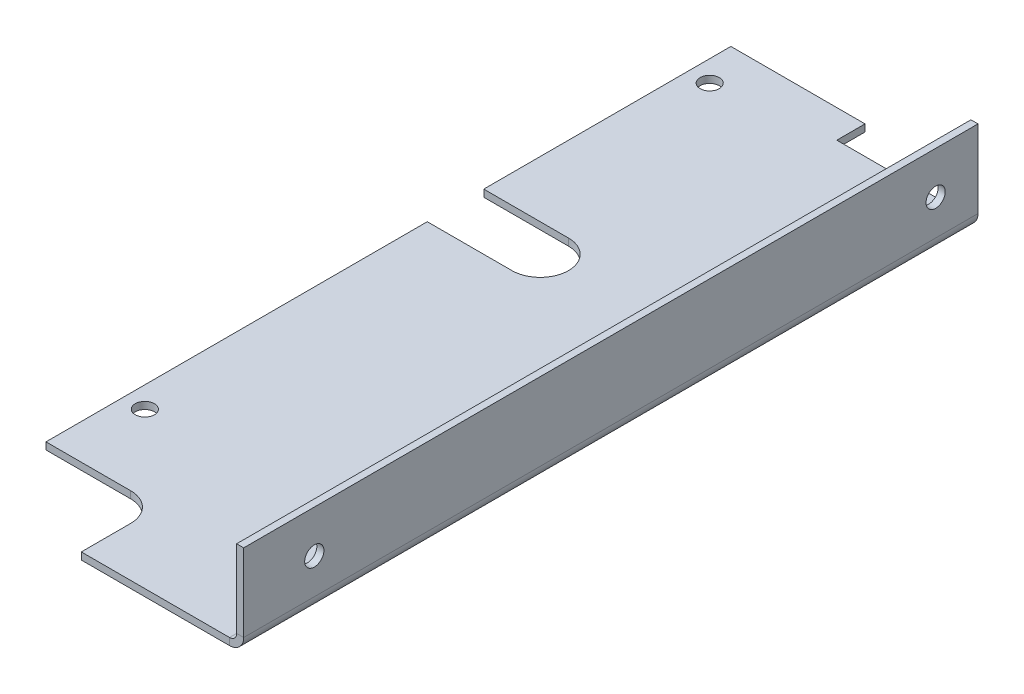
ISO-10303-21;
HEADER;
FILE_DESCRIPTION(('STEP AP214'),'2;1');
FILE_NAME('part.step','',(''),(''),'','','');
FILE_SCHEMA(('AUTOMOTIVE_DESIGN { 1 0 10303 214 1 1 1 1 }'));
ENDSEC;
DATA;
#1=APPLICATION_CONTEXT('core data for automotive mechanical design processes');
#2=APPLICATION_PROTOCOL_DEFINITION('international standard','automotive_design',2000,#1);
#3=PRODUCT_CONTEXT('',#1,'mechanical');
#4=PRODUCT('Part','Part','',(#3));
#5=PRODUCT_RELATED_PRODUCT_CATEGORY('part','',(#4));
#6=PRODUCT_DEFINITION_FORMATION('','',#4);
#7=PRODUCT_DEFINITION_CONTEXT('part definition',#1,'design');
#8=PRODUCT_DEFINITION('design','',#6,#7);
#9=PRODUCT_DEFINITION_SHAPE('','',#8);
#10=(LENGTH_UNIT() NAMED_UNIT(*) SI_UNIT(.MILLI.,.METRE.));
#11=(NAMED_UNIT(*) PLANE_ANGLE_UNIT() SI_UNIT($,.RADIAN.));
#12=(NAMED_UNIT(*) SI_UNIT($,.STERADIAN.) SOLID_ANGLE_UNIT());
#13=UNCERTAINTY_MEASURE_WITH_UNIT(LENGTH_MEASURE(1.E-05),#10,'distance_accuracy_value','');
#14=(GEOMETRIC_REPRESENTATION_CONTEXT(3) GLOBAL_UNCERTAINTY_ASSIGNED_CONTEXT((#13)) GLOBAL_UNIT_ASSIGNED_CONTEXT((#10,
#11,#12)) REPRESENTATION_CONTEXT('',''));
#15=CARTESIAN_POINT('',(0.,0.,0.));
#16=DIRECTION('',(0.,0.,1.));
#17=DIRECTION('',(1.,0.,0.));
#18=AXIS2_PLACEMENT_3D('',#15,#16,#17);
#19=CARTESIAN_POINT('',(97.5,2.5,-270.));
#20=DIRECTION('',(0.,0.,-1.));
#21=DIRECTION('',(-1.,0.,0.));
#22=AXIS2_PLACEMENT_3D('',#19,#20,#21);
#23=PLANE('',#22);
#24=DIRECTION('',(1.,0.,0.));
#25=VECTOR('',#24,1.);
#26=CARTESIAN_POINT('',(0.,0.,-270.));
#27=LINE('',#26,#25);
#28=CARTESIAN_POINT('',(0.,0.,-270.));
#29=VERTEX_POINT('',#28);
#30=CARTESIAN_POINT('',(47.5,0.,-270.));
#31=VERTEX_POINT('',#30);
#32=EDGE_CURVE('E250',#29,#31,#27,.T.);
#33=ORIENTED_EDGE('',*,*,#32,.T.);
#34=DIRECTION('',(0.,-1.,0.));
#35=VECTOR('',#34,1.);
#36=CARTESIAN_POINT('',(47.5,30.,-270.));
#37=LINE('',#36,#35);
#38=CARTESIAN_POINT('',(47.5,-2.5,-270.));
#39=VERTEX_POINT('',#38);
#40=EDGE_CURVE('E394',#31,#39,#37,.T.);
#41=ORIENTED_EDGE('',*,*,#40,.T.);
#42=DIRECTION('',(1.,0.,0.));
#43=VECTOR('',#42,1.);
#44=CARTESIAN_POINT('',(0.,-2.5,-270.));
#45=LINE('',#44,#43);
#46=CARTESIAN_POINT('',(0.,-2.5,-270.));
#47=VERTEX_POINT('',#46);
#48=EDGE_CURVE('E193',#47,#39,#45,.T.);
#49=ORIENTED_EDGE('',*,*,#48,.F.);
#50=DIRECTION('',(0.,1.,0.));
#51=VECTOR('',#50,1.);
#52=CARTESIAN_POINT('',(0.,-2.5,-270.));
#53=LINE('',#52,#51);
#54=EDGE_CURVE('E202',#47,#29,#53,.T.);
#55=ORIENTED_EDGE('',*,*,#54,.T.);
#56=EDGE_LOOP('',(#33,#41,#49,#55));
#57=FACE_BOUND('',#56,.T.);
#58=ADVANCED_FACE('F49',(#57),#23,.T.);
#59=CARTESIAN_POINT('',(97.5,0.,-270.));
#60=DIRECTION('',(1.,0.,0.));
#61=DIRECTION('',(0.,0.,-1.));
#62=AXIS2_PLACEMENT_3D('',#59,#60,#61);
#63=PLANE('',#62);
#64=CARTESIAN_POINT('',(97.5,15.,-25.));
#65=DIRECTION('',(1.,0.,0.));
#66=DIRECTION('',(0.,0.,-1.));
#67=AXIS2_PLACEMENT_3D('',#64,#65,#66);
#68=CIRCLE('',#67,3.39999999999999);
#69=CARTESIAN_POINT('',(97.5,15.,-28.4));
#70=VERTEX_POINT('',#69);
#71=EDGE_CURVE('E308',#70,#70,#68,.T.);
#72=ORIENTED_EDGE('',*,*,#71,.F.);
#73=EDGE_LOOP('',(#72));
#74=FACE_BOUND('',#73,.T.);
#75=CARTESIAN_POINT('',(97.5,15.,-245.));
#76=DIRECTION('',(1.,0.,0.));
#77=DIRECTION('',(0.,0.,-1.));
#78=AXIS2_PLACEMENT_3D('',#75,#76,#77);
#79=CIRCLE('',#78,3.39999999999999);
#80=CARTESIAN_POINT('',(97.5,15.,-248.4));
#81=VERTEX_POINT('',#80);
#82=EDGE_CURVE('E315',#81,#81,#79,.T.);
#83=ORIENTED_EDGE('',*,*,#82,.F.);
#84=EDGE_LOOP('',(#83));
#85=FACE_BOUND('',#84,.T.);
#86=DIRECTION('',(0.,0.,1.));
#87=VECTOR('',#86,1.);
#88=CARTESIAN_POINT('',(97.5,2.5,-270.));
#89=LINE('',#88,#87);
#90=CARTESIAN_POINT('',(97.5,2.5,-260.));
#91=VERTEX_POINT('',#90);
#92=CARTESIAN_POINT('',(97.5,2.5,0.));
#93=VERTEX_POINT('',#92);
#94=EDGE_CURVE('E183',#91,#93,#89,.T.);
#95=ORIENTED_EDGE('',*,*,#94,.F.);
#96=DIRECTION('',(0.,-1.,0.));
#97=VECTOR('',#96,1.);
#98=CARTESIAN_POINT('',(97.5,30.,-260.));
#99=LINE('',#98,#97);
#100=CARTESIAN_POINT('',(97.5,30.,-260.));
#101=VERTEX_POINT('',#100);
#102=EDGE_CURVE('E169',#101,#91,#99,.T.);
#103=ORIENTED_EDGE('',*,*,#102,.F.);
#104=DIRECTION('',(0.,0.,1.));
#105=VECTOR('',#104,1.);
#106=CARTESIAN_POINT('',(97.5,30.,-270.));
#107=LINE('',#106,#105);
#108=CARTESIAN_POINT('',(97.5,30.,0.));
#109=VERTEX_POINT('',#108);
#110=EDGE_CURVE('E181',#101,#109,#107,.T.);
#111=ORIENTED_EDGE('',*,*,#110,.T.);
#112=DIRECTION('',(0.,1.,0.));
#113=VECTOR('',#112,1.);
#114=CARTESIAN_POINT('',(97.5,0.,0.));
#115=LINE('',#114,#113);
#116=EDGE_CURVE('E218',#93,#109,#115,.T.);
#117=ORIENTED_EDGE('',*,*,#116,.F.);
#118=EDGE_LOOP('',(#95,#103,#111,#117));
#119=FACE_BOUND('',#118,.T.);
#120=ADVANCED_FACE('F179',(#74,#85,#119),#63,.T.);
#121=CARTESIAN_POINT('',(92.5,2.5,-270.));
#122=DIRECTION('',(0.,0.,1.));
#123=DIRECTION('',(1.,0.,0.));
#124=AXIS2_PLACEMENT_3D('',#121,#122,#123);
#125=CYLINDRICAL_SURFACE('',#124,5.);
#126=DIRECTION('',(0.,0.,1.));
#127=VECTOR('',#126,1.);
#128=CARTESIAN_POINT('',(92.5,-2.5,-270.));
#129=LINE('',#128,#127);
#130=CARTESIAN_POINT('',(92.5,-2.5,-260.));
#131=VERTEX_POINT('',#130);
#132=CARTESIAN_POINT('',(92.5,-2.5,0.));
#133=VERTEX_POINT('',#132);
#134=EDGE_CURVE('E243',#131,#133,#129,.T.);
#135=ORIENTED_EDGE('',*,*,#134,.F.);
#136=CARTESIAN_POINT('',(92.5,2.5,-260.));
#137=DIRECTION('',(0.,0.,-1.));
#138=DIRECTION('',(-1.,0.,0.));
#139=AXIS2_PLACEMENT_3D('',#136,#137,#138);
#140=CIRCLE('',#139,5.);
#141=EDGE_CURVE('E383',#131,#91,#140,.F.);
#142=ORIENTED_EDGE('',*,*,#141,.T.);
#143=ORIENTED_EDGE('',*,*,#94,.T.);
#144=CARTESIAN_POINT('',(92.5,2.5,0.));
#145=DIRECTION('',(0.,0.,1.));
#146=DIRECTION('',(1.,0.,0.));
#147=AXIS2_PLACEMENT_3D('',#144,#145,#146);
#148=CIRCLE('',#147,5.);
#149=EDGE_CURVE('E245',#133,#93,#148,.T.);
#150=ORIENTED_EDGE('',*,*,#149,.F.);
#151=EDGE_LOOP('',(#135,#142,#143,#150));
#152=FACE_BOUND('',#151,.T.);
#153=ADVANCED_FACE('F419',(#152),#125,.T.);
#154=CARTESIAN_POINT('',(0.,-2.5,-270.));
#155=DIRECTION('',(0.,-1.,0.));
#156=DIRECTION('',(0.,0.,-1.));
#157=AXIS2_PLACEMENT_3D('',#154,#155,#156);
#158=PLANE('',#157);
#159=CARTESIAN_POINT('',(7.5,-2.5,-255.));
#160=DIRECTION('',(0.,-1.,0.));
#161=DIRECTION('',(0.,0.,-1.));
#162=AXIS2_PLACEMENT_3D('',#159,#160,#161);
#163=CIRCLE('',#162,3.39999999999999);
#164=CARTESIAN_POINT('',(7.5,-2.5,-258.4));
#165=VERTEX_POINT('',#164);
#166=EDGE_CURVE('E219',#165,#165,#163,.T.);
#167=ORIENTED_EDGE('',*,*,#166,.F.);
#168=EDGE_LOOP('',(#167));
#169=FACE_BOUND('',#168,.T.);
#170=CARTESIAN_POINT('',(7.5,-2.5,-55.));
#171=DIRECTION('',(0.,-1.,0.));
#172=DIRECTION('',(0.,0.,-1.));
#173=AXIS2_PLACEMENT_3D('',#170,#171,#172);
#174=CIRCLE('',#173,3.39999999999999);
#175=CARTESIAN_POINT('',(7.5,-2.5,-58.4));
#176=VERTEX_POINT('',#175);
#177=EDGE_CURVE('E223',#176,#176,#174,.T.);
#178=ORIENTED_EDGE('',*,*,#177,.F.);
#179=EDGE_LOOP('',(#178));
#180=FACE_BOUND('',#179,.T.);
#181=ORIENTED_EDGE('',*,*,#48,.T.);
#182=DIRECTION('',(0.,0.,1.));
#183=VECTOR('',#182,1.);
#184=CARTESIAN_POINT('',(47.5,-2.5,-270.));
#185=LINE('',#184,#183);
#186=CARTESIAN_POINT('',(47.5,-2.5,-260.));
#187=VERTEX_POINT('',#186);
#188=EDGE_CURVE('E402',#39,#187,#185,.T.);
#189=ORIENTED_EDGE('',*,*,#188,.T.);
#190=DIRECTION('',(1.,0.,0.));
#191=VECTOR('',#190,1.);
#192=CARTESIAN_POINT('',(97.5,-2.5,-260.));
#193=LINE('',#192,#191);
#194=EDGE_CURVE('E175',#187,#131,#193,.T.);
#195=ORIENTED_EDGE('',*,*,#194,.T.);
#196=ORIENTED_EDGE('',*,*,#134,.T.);
#197=DIRECTION('',(1.,0.,0.));
#198=VECTOR('',#197,1.);
#199=CARTESIAN_POINT('',(0.,-2.5,0.));
#200=LINE('',#199,#198);
#201=CARTESIAN_POINT('',(40.,-2.5,0.));
#202=VERTEX_POINT('',#201);
#203=EDGE_CURVE('E232',#202,#133,#200,.T.);
#204=ORIENTED_EDGE('',*,*,#203,.F.);
#205=DIRECTION('',(0.,0.,1.));
#206=VECTOR('',#205,1.);
#207=CARTESIAN_POINT('',(40.,-2.5,-270.));
#208=LINE('',#207,#206);
#209=CARTESIAN_POINT('',(40.,-2.5,-17.5));
#210=VERTEX_POINT('',#209);
#211=EDGE_CURVE('E72',#210,#202,#208,.T.);
#212=ORIENTED_EDGE('',*,*,#211,.F.);
#213=CARTESIAN_POINT('',(30.,-2.5,-17.5));
#214=DIRECTION('',(0.,-1.,0.));
#215=DIRECTION('',(0.,0.,-1.));
#216=AXIS2_PLACEMENT_3D('',#213,#214,#215);
#217=CIRCLE('',#216,10.);
#218=CARTESIAN_POINT('',(30.,-2.5,-27.5));
#219=VERTEX_POINT('',#218);
#220=EDGE_CURVE('E358',#219,#210,#217,.T.);
#221=ORIENTED_EDGE('',*,*,#220,.F.);
#222=DIRECTION('',(1.,0.,0.));
#223=VECTOR('',#222,1.);
#224=CARTESIAN_POINT('',(0.,-2.5,-27.5));
#225=LINE('',#224,#223);
#226=CARTESIAN_POINT('',(0.,-2.5,-27.5));
#227=VERTEX_POINT('',#226);
#228=EDGE_CURVE('E355',#227,#219,#225,.T.);
#229=ORIENTED_EDGE('',*,*,#228,.F.);
#230=DIRECTION('',(0.,0.,1.));
#231=VECTOR('',#230,1.);
#232=CARTESIAN_POINT('',(0.,-2.5,-270.));
#233=LINE('',#232,#231);
#234=CARTESIAN_POINT('',(0.,-2.5,-162.5));
#235=VERTEX_POINT('',#234);
#236=EDGE_CURVE('E268',#235,#227,#233,.T.);
#237=ORIENTED_EDGE('',*,*,#236,.F.);
#238=DIRECTION('',(-1.,0.,0.));
#239=VECTOR('',#238,1.);
#240=CARTESIAN_POINT('',(0.,-2.5,-162.5));
#241=LINE('',#240,#239);
#242=CARTESIAN_POINT('',(30.,-2.5,-162.5));
#243=VERTEX_POINT('',#242);
#244=EDGE_CURVE('E328',#243,#235,#241,.T.);
#245=ORIENTED_EDGE('',*,*,#244,.F.);
#246=CARTESIAN_POINT('',(30.,-2.5,-172.5));
#247=DIRECTION('',(0.,-1.,0.));
#248=DIRECTION('',(0.,0.,-1.));
#249=AXIS2_PLACEMENT_3D('',#246,#247,#248);
#250=CIRCLE('',#249,10.);
#251=CARTESIAN_POINT('',(30.,-2.5,-182.5));
#252=VERTEX_POINT('',#251);
#253=EDGE_CURVE('E325',#252,#243,#250,.T.);
#254=ORIENTED_EDGE('',*,*,#253,.F.);
#255=DIRECTION('',(1.,0.,0.));
#256=VECTOR('',#255,1.);
#257=CARTESIAN_POINT('',(0.,-2.5,-182.5));
#258=LINE('',#257,#256);
#259=CARTESIAN_POINT('',(0.,-2.5,-182.5));
#260=VERTEX_POINT('',#259);
#261=EDGE_CURVE('E323',#260,#252,#258,.T.);
#262=ORIENTED_EDGE('',*,*,#261,.F.);
#263=EDGE_CURVE('E264',#47,#260,#233,.T.);
#264=ORIENTED_EDGE('',*,*,#263,.F.);
#265=EDGE_LOOP('',(#181,#189,#195,#196,#204,#212,#221,#229,#237,#245,#254,#262,#264));
#266=FACE_BOUND('',#265,.T.);
#267=ADVANCED_FACE('F239',(#169,#180,#266),#158,.T.);
#268=CARTESIAN_POINT('',(0.,0.,-270.));
#269=DIRECTION('',(0.,-1.,0.));
#270=DIRECTION('',(0.,0.,-1.));
#271=AXIS2_PLACEMENT_3D('',#268,#269,#270);
#272=PLANE('',#271);
#273=CARTESIAN_POINT('',(7.5,0.,-255.));
#274=DIRECTION('',(0.,-1.,0.));
#275=DIRECTION('',(0.,0.,-1.));
#276=AXIS2_PLACEMENT_3D('',#273,#274,#275);
#277=CIRCLE('',#276,3.39999999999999);
#278=CARTESIAN_POINT('',(7.5,0.,-258.4));
#279=VERTEX_POINT('',#278);
#280=EDGE_CURVE('E214',#279,#279,#277,.T.);
#281=ORIENTED_EDGE('',*,*,#280,.T.);
#282=EDGE_LOOP('',(#281));
#283=FACE_BOUND('',#282,.T.);
#284=CARTESIAN_POINT('',(7.5,0.,-55.));
#285=DIRECTION('',(0.,-1.,0.));
#286=DIRECTION('',(0.,0.,-1.));
#287=AXIS2_PLACEMENT_3D('',#284,#285,#286);
#288=CIRCLE('',#287,3.39999999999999);
#289=CARTESIAN_POINT('',(7.5,0.,-58.4));
#290=VERTEX_POINT('',#289);
#291=EDGE_CURVE('E220',#290,#290,#288,.T.);
#292=ORIENTED_EDGE('',*,*,#291,.T.);
#293=EDGE_LOOP('',(#292));
#294=FACE_BOUND('',#293,.T.);
#295=DIRECTION('',(0.,0.,1.));
#296=VECTOR('',#295,1.);
#297=CARTESIAN_POINT('',(47.5,0.,-270.));
#298=LINE('',#297,#296);
#299=CARTESIAN_POINT('',(47.5,0.,-260.));
#300=VERTEX_POINT('',#299);
#301=EDGE_CURVE('E12',#31,#300,#298,.T.);
#302=ORIENTED_EDGE('',*,*,#301,.F.);
#303=ORIENTED_EDGE('',*,*,#32,.F.);
#304=DIRECTION('',(0.,0.,1.));
#305=VECTOR('',#304,1.);
#306=CARTESIAN_POINT('',(0.,0.,-270.));
#307=LINE('',#306,#305);
#308=CARTESIAN_POINT('',(0.,0.,-182.5));
#309=VERTEX_POINT('',#308);
#310=EDGE_CURVE('E269',#29,#309,#307,.T.);
#311=ORIENTED_EDGE('',*,*,#310,.T.);
#312=DIRECTION('',(-1.,0.,0.));
#313=VECTOR('',#312,1.);
#314=CARTESIAN_POINT('',(0.,0.,-182.5));
#315=LINE('',#314,#313);
#316=CARTESIAN_POINT('',(30.,0.,-182.5));
#317=VERTEX_POINT('',#316);
#318=EDGE_CURVE('E336',#317,#309,#315,.T.);
#319=ORIENTED_EDGE('',*,*,#318,.F.);
#320=CARTESIAN_POINT('',(30.,0.,-172.5));
#321=DIRECTION('',(0.,1.,0.));
#322=DIRECTION('',(0.,0.,1.));
#323=AXIS2_PLACEMENT_3D('',#320,#321,#322);
#324=CIRCLE('',#323,10.);
#325=CARTESIAN_POINT('',(30.,0.,-162.5));
#326=VERTEX_POINT('',#325);
#327=EDGE_CURVE('E347',#326,#317,#324,.T.);
#328=ORIENTED_EDGE('',*,*,#327,.F.);
#329=DIRECTION('',(1.,0.,0.));
#330=VECTOR('',#329,1.);
#331=CARTESIAN_POINT('',(0.,0.,-162.5));
#332=LINE('',#331,#330);
#333=CARTESIAN_POINT('',(0.,0.,-162.5));
#334=VERTEX_POINT('',#333);
#335=EDGE_CURVE('E351',#334,#326,#332,.T.);
#336=ORIENTED_EDGE('',*,*,#335,.F.);
#337=CARTESIAN_POINT('',(0.,0.,-27.5));
#338=VERTEX_POINT('',#337);
#339=EDGE_CURVE('E273',#334,#338,#307,.T.);
#340=ORIENTED_EDGE('',*,*,#339,.T.);
#341=DIRECTION('',(-1.,0.,0.));
#342=VECTOR('',#341,1.);
#343=CARTESIAN_POINT('',(0.,0.,-27.5));
#344=LINE('',#343,#342);
#345=CARTESIAN_POINT('',(30.,0.,-27.5));
#346=VERTEX_POINT('',#345);
#347=EDGE_CURVE('E380',#346,#338,#344,.T.);
#348=ORIENTED_EDGE('',*,*,#347,.F.);
#349=CARTESIAN_POINT('',(30.,0.,-17.5));
#350=DIRECTION('',(0.,1.,0.));
#351=DIRECTION('',(0.,0.,1.));
#352=AXIS2_PLACEMENT_3D('',#349,#350,#351);
#353=CIRCLE('',#352,10.);
#354=CARTESIAN_POINT('',(40.,0.,-17.5));
#355=VERTEX_POINT('',#354);
#356=EDGE_CURVE('E369',#355,#346,#353,.T.);
#357=ORIENTED_EDGE('',*,*,#356,.F.);
#358=DIRECTION('',(0.,0.,-1.));
#359=VECTOR('',#358,1.);
#360=CARTESIAN_POINT('',(40.,0.,-17.5));
#361=LINE('',#360,#359);
#362=CARTESIAN_POINT('',(40.,0.,0.));
#363=VERTEX_POINT('',#362);
#364=EDGE_CURVE('E377',#363,#355,#361,.T.);
#365=ORIENTED_EDGE('',*,*,#364,.F.);
#366=DIRECTION('',(1.,0.,0.));
#367=VECTOR('',#366,1.);
#368=CARTESIAN_POINT('',(0.,0.,0.));
#369=LINE('',#368,#367);
#370=CARTESIAN_POINT('',(92.5,0.,0.));
#371=VERTEX_POINT('',#370);
#372=EDGE_CURVE('E235',#363,#371,#369,.T.);
#373=ORIENTED_EDGE('',*,*,#372,.T.);
#374=DIRECTION('',(0.,0.,1.));
#375=VECTOR('',#374,1.);
#376=CARTESIAN_POINT('',(92.5,0.,-270.));
#377=LINE('',#376,#375);
#378=CARTESIAN_POINT('',(92.5,0.,-260.));
#379=VERTEX_POINT('',#378);
#380=EDGE_CURVE('E274',#379,#371,#377,.T.);
#381=ORIENTED_EDGE('',*,*,#380,.F.);
#382=DIRECTION('',(1.,0.,0.));
#383=VECTOR('',#382,1.);
#384=CARTESIAN_POINT('',(0.,0.,-260.));
#385=LINE('',#384,#383);
#386=EDGE_CURVE('E386',#300,#379,#385,.T.);
#387=ORIENTED_EDGE('',*,*,#386,.F.);
#388=EDGE_LOOP('',(#302,#303,#311,#319,#328,#336,#340,#348,#357,#365,#373,#381,#387));
#389=FACE_BOUND('',#388,.T.);
#390=ADVANCED_FACE('F415',(#283,#294,#389),#272,.F.);
#391=CARTESIAN_POINT('',(92.5,2.5,-270.));
#392=DIRECTION('',(0.,0.,1.));
#393=DIRECTION('',(1.,0.,0.));
#394=AXIS2_PLACEMENT_3D('',#391,#392,#393);
#395=CYLINDRICAL_SURFACE('',#394,2.5);
#396=CARTESIAN_POINT('',(92.5,2.5,-260.));
#397=DIRECTION('',(0.,0.,-1.));
#398=DIRECTION('',(-1.,0.,0.));
#399=AXIS2_PLACEMENT_3D('',#396,#397,#398);
#400=CIRCLE('',#399,2.5);
#401=CARTESIAN_POINT('',(95.,2.5,-260.));
#402=VERTEX_POINT('',#401);
#403=EDGE_CURVE('E389',#379,#402,#400,.F.);
#404=ORIENTED_EDGE('',*,*,#403,.F.);
#405=ORIENTED_EDGE('',*,*,#380,.T.);
#406=CARTESIAN_POINT('',(92.5,2.5,0.));
#407=DIRECTION('',(0.,0.,-1.));
#408=DIRECTION('',(-1.,0.,0.));
#409=AXIS2_PLACEMENT_3D('',#406,#407,#408);
#410=CIRCLE('',#409,2.5);
#411=CARTESIAN_POINT('',(95.,2.5,0.));
#412=VERTEX_POINT('',#411);
#413=EDGE_CURVE('E253',#371,#412,#410,.F.);
#414=ORIENTED_EDGE('',*,*,#413,.T.);
#415=DIRECTION('',(0.,0.,1.));
#416=VECTOR('',#415,1.);
#417=CARTESIAN_POINT('',(95.,2.5,-270.));
#418=LINE('',#417,#416);
#419=EDGE_CURVE('E198',#402,#412,#418,.T.);
#420=ORIENTED_EDGE('',*,*,#419,.F.);
#421=EDGE_LOOP('',(#404,#405,#414,#420));
#422=FACE_BOUND('',#421,.T.);
#423=ADVANCED_FACE('F292',(#422),#395,.F.);
#424=CARTESIAN_POINT('',(95.,0.,-270.));
#425=DIRECTION('',(1.,0.,0.));
#426=DIRECTION('',(0.,0.,-1.));
#427=AXIS2_PLACEMENT_3D('',#424,#425,#426);
#428=PLANE('',#427);
#429=CARTESIAN_POINT('',(95.,15.,-25.));
#430=DIRECTION('',(-1.,0.,0.));
#431=DIRECTION('',(0.,0.,1.));
#432=AXIS2_PLACEMENT_3D('',#429,#430,#431);
#433=CIRCLE('',#432,3.39999999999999);
#434=CARTESIAN_POINT('',(95.,15.,-21.6));
#435=VERTEX_POINT('',#434);
#436=EDGE_CURVE('E312',#435,#435,#433,.T.);
#437=ORIENTED_EDGE('',*,*,#436,.F.);
#438=EDGE_LOOP('',(#437));
#439=FACE_BOUND('',#438,.T.);
#440=CARTESIAN_POINT('',(95.,15.,-245.));
#441=DIRECTION('',(-1.,0.,0.));
#442=DIRECTION('',(0.,0.,1.));
#443=AXIS2_PLACEMENT_3D('',#440,#441,#442);
#444=CIRCLE('',#443,3.39999999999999);
#445=CARTESIAN_POINT('',(95.,15.,-241.6));
#446=VERTEX_POINT('',#445);
#447=EDGE_CURVE('E319',#446,#446,#444,.T.);
#448=ORIENTED_EDGE('',*,*,#447,.F.);
#449=EDGE_LOOP('',(#448));
#450=FACE_BOUND('',#449,.T.);
#451=DIRECTION('',(0.,1.,0.));
#452=VECTOR('',#451,1.);
#453=CARTESIAN_POINT('',(95.,0.,-260.));
#454=LINE('',#453,#452);
#455=CARTESIAN_POINT('',(95.,30.,-260.));
#456=VERTEX_POINT('',#455);
#457=EDGE_CURVE('E64',#402,#456,#454,.T.);
#458=ORIENTED_EDGE('',*,*,#457,.F.);
#459=ORIENTED_EDGE('',*,*,#419,.T.);
#460=DIRECTION('',(0.,1.,0.));
#461=VECTOR('',#460,1.);
#462=CARTESIAN_POINT('',(95.,0.,0.));
#463=LINE('',#462,#461);
#464=CARTESIAN_POINT('',(95.,30.,0.));
#465=VERTEX_POINT('',#464);
#466=EDGE_CURVE('E283',#412,#465,#463,.T.);
#467=ORIENTED_EDGE('',*,*,#466,.T.);
#468=DIRECTION('',(0.,0.,1.));
#469=VECTOR('',#468,1.);
#470=CARTESIAN_POINT('',(95.,30.,-270.));
#471=LINE('',#470,#469);
#472=EDGE_CURVE('E192',#456,#465,#471,.T.);
#473=ORIENTED_EDGE('',*,*,#472,.F.);
#474=EDGE_LOOP('',(#458,#459,#467,#473));
#475=FACE_BOUND('',#474,.T.);
#476=ADVANCED_FACE('F281',(#439,#450,#475),#428,.F.);
#477=CARTESIAN_POINT('',(95.,30.,-270.));
#478=DIRECTION('',(0.,-1.,0.));
#479=DIRECTION('',(0.,0.,-1.));
#480=AXIS2_PLACEMENT_3D('',#477,#478,#479);
#481=PLANE('',#480);
#482=DIRECTION('',(1.,0.,0.));
#483=VECTOR('',#482,1.);
#484=CARTESIAN_POINT('',(97.5,30.,-260.));
#485=LINE('',#484,#483);
#486=EDGE_CURVE('E165',#456,#101,#485,.T.);
#487=ORIENTED_EDGE('',*,*,#486,.F.);
#488=ORIENTED_EDGE('',*,*,#472,.T.);
#489=DIRECTION('',(1.,0.,0.));
#490=VECTOR('',#489,1.);
#491=CARTESIAN_POINT('',(95.,30.,0.));
#492=LINE('',#491,#490);
#493=EDGE_CURVE('E189',#465,#109,#492,.T.);
#494=ORIENTED_EDGE('',*,*,#493,.T.);
#495=ORIENTED_EDGE('',*,*,#110,.F.);
#496=EDGE_LOOP('',(#487,#488,#494,#495));
#497=FACE_BOUND('',#496,.T.);
#498=ADVANCED_FACE('F187',(#497),#481,.F.);
#499=CARTESIAN_POINT('',(0.,-2.5,-270.));
#500=DIRECTION('',(1.,0.,0.));
#501=DIRECTION('',(0.,0.,-1.));
#502=AXIS2_PLACEMENT_3D('',#499,#500,#501);
#503=PLANE('',#502);
#504=ORIENTED_EDGE('',*,*,#263,.T.);
#505=DIRECTION('',(0.,1.,0.));
#506=VECTOR('',#505,1.);
#507=CARTESIAN_POINT('',(0.,-10.,-182.5));
#508=LINE('',#507,#506);
#509=EDGE_CURVE('E331',#260,#309,#508,.T.);
#510=ORIENTED_EDGE('',*,*,#509,.T.);
#511=ORIENTED_EDGE('',*,*,#310,.F.);
#512=ORIENTED_EDGE('',*,*,#54,.F.);
#513=EDGE_LOOP('',(#504,#510,#511,#512));
#514=FACE_BOUND('',#513,.T.);
#515=ADVANCED_FACE('F475',(#514),#503,.F.);
#516=CARTESIAN_POINT('',(95.,2.5,0.));
#517=DIRECTION('',(0.,0.,1.));
#518=DIRECTION('',(1.,0.,0.));
#519=AXIS2_PLACEMENT_3D('',#516,#517,#518);
#520=PLANE('',#519);
#521=DIRECTION('',(1.,0.,0.));
#522=VECTOR('',#521,1.);
#523=CARTESIAN_POINT('',(95.,2.5,0.));
#524=LINE('',#523,#522);
#525=EDGE_CURVE('E210',#412,#93,#524,.T.);
#526=ORIENTED_EDGE('',*,*,#525,.F.);
#527=ORIENTED_EDGE('',*,*,#413,.F.);
#528=DIRECTION('',(0.,1.,0.));
#529=VECTOR('',#528,1.);
#530=CARTESIAN_POINT('',(92.5,-2.5,0.));
#531=LINE('',#530,#529);
#532=EDGE_CURVE('E206',#133,#371,#531,.T.);
#533=ORIENTED_EDGE('',*,*,#532,.F.);
#534=ORIENTED_EDGE('',*,*,#149,.T.);
#535=EDGE_LOOP('',(#526,#527,#533,#534));
#536=FACE_BOUND('',#535,.T.);
#537=ADVANCED_FACE('F289',(#536),#520,.T.);
#538=CARTESIAN_POINT('',(92.5,-2.5,0.));
#539=DIRECTION('',(0.,0.,1.));
#540=DIRECTION('',(1.,0.,0.));
#541=AXIS2_PLACEMENT_3D('',#538,#539,#540);
#542=PLANE('',#541);
#543=ORIENTED_EDGE('',*,*,#466,.F.);
#544=ORIENTED_EDGE('',*,*,#525,.T.);
#545=ORIENTED_EDGE('',*,*,#116,.T.);
#546=ORIENTED_EDGE('',*,*,#493,.F.);
#547=EDGE_LOOP('',(#543,#544,#545,#546));
#548=FACE_BOUND('',#547,.T.);
#549=ADVANCED_FACE('F295',(#548),#542,.T.);
#550=ORIENTED_EDGE('',*,*,#236,.T.);
#551=DIRECTION('',(0.,1.,0.));
#552=VECTOR('',#551,1.);
#553=CARTESIAN_POINT('',(0.,-10.,-27.5));
#554=LINE('',#553,#552);
#555=EDGE_CURVE('E364',#227,#338,#554,.T.);
#556=ORIENTED_EDGE('',*,*,#555,.T.);
#557=ORIENTED_EDGE('',*,*,#339,.F.);
#558=DIRECTION('',(0.,1.,0.));
#559=VECTOR('',#558,1.);
#560=CARTESIAN_POINT('',(0.,-10.,-162.5));
#561=LINE('',#560,#559);
#562=EDGE_CURVE('E332',#235,#334,#561,.T.);
#563=ORIENTED_EDGE('',*,*,#562,.F.);
#564=EDGE_LOOP('',(#550,#556,#557,#563));
#565=FACE_BOUND('',#564,.T.);
#566=ADVANCED_FACE('F486',(#565),#503,.F.);
#567=CARTESIAN_POINT('',(92.5,2.5,0.));
#568=DIRECTION('',(0.,0.,-1.));
#569=DIRECTION('',(-1.,0.,0.));
#570=AXIS2_PLACEMENT_3D('',#567,#568,#569);
#571=PLANE('',#570);
#572=ORIENTED_EDGE('',*,*,#372,.F.);
#573=DIRECTION('',(0.,-1.,0.));
#574=VECTOR('',#573,1.);
#575=CARTESIAN_POINT('',(40.,2.5,0.));
#576=LINE('',#575,#574);
#577=EDGE_CURVE('E57',#363,#202,#576,.T.);
#578=ORIENTED_EDGE('',*,*,#577,.T.);
#579=ORIENTED_EDGE('',*,*,#203,.T.);
#580=ORIENTED_EDGE('',*,*,#532,.T.);
#581=EDGE_LOOP('',(#572,#578,#579,#580));
#582=FACE_BOUND('',#581,.T.);
#583=ADVANCED_FACE('F231',(#582),#571,.F.);
#584=CARTESIAN_POINT('',(7.5,-2.5,-255.));
#585=DIRECTION('',(0.,-1.,0.));
#586=DIRECTION('',(0.,0.,-1.));
#587=AXIS2_PLACEMENT_3D('',#584,#585,#586);
#588=CYLINDRICAL_SURFACE('',#587,3.39999999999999);
#589=ORIENTED_EDGE('',*,*,#166,.T.);
#590=EDGE_LOOP('',(#589));
#591=FACE_BOUND('',#590,.T.);
#592=ORIENTED_EDGE('',*,*,#280,.F.);
#593=EDGE_LOOP('',(#592));
#594=FACE_BOUND('',#593,.T.);
#595=ADVANCED_FACE('F515',(#591,#594),#588,.F.);
#596=CARTESIAN_POINT('',(7.5,-2.5,-55.));
#597=DIRECTION('',(0.,-1.,0.));
#598=DIRECTION('',(0.,0.,-1.));
#599=AXIS2_PLACEMENT_3D('',#596,#597,#598);
#600=CYLINDRICAL_SURFACE('',#599,3.39999999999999);
#601=ORIENTED_EDGE('',*,*,#177,.T.);
#602=EDGE_LOOP('',(#601));
#603=FACE_BOUND('',#602,.T.);
#604=ORIENTED_EDGE('',*,*,#291,.F.);
#605=EDGE_LOOP('',(#604));
#606=FACE_BOUND('',#605,.T.);
#607=ADVANCED_FACE('F522',(#603,#606),#600,.F.);
#608=CARTESIAN_POINT('',(95.,15.,-25.));
#609=DIRECTION('',(-1.,0.,0.));
#610=DIRECTION('',(0.,0.,1.));
#611=AXIS2_PLACEMENT_3D('',#608,#609,#610);
#612=CYLINDRICAL_SURFACE('',#611,3.39999999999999);
#613=ORIENTED_EDGE('',*,*,#71,.T.);
#614=EDGE_LOOP('',(#613));
#615=FACE_BOUND('',#614,.T.);
#616=ORIENTED_EDGE('',*,*,#436,.T.);
#617=EDGE_LOOP('',(#616));
#618=FACE_BOUND('',#617,.T.);
#619=ADVANCED_FACE('F531',(#615,#618),#612,.F.);
#620=CARTESIAN_POINT('',(95.,15.,-245.));
#621=DIRECTION('',(-1.,0.,0.));
#622=DIRECTION('',(0.,0.,1.));
#623=AXIS2_PLACEMENT_3D('',#620,#621,#622);
#624=CYLINDRICAL_SURFACE('',#623,3.39999999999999);
#625=ORIENTED_EDGE('',*,*,#82,.T.);
#626=EDGE_LOOP('',(#625));
#627=FACE_BOUND('',#626,.T.);
#628=ORIENTED_EDGE('',*,*,#447,.T.);
#629=EDGE_LOOP('',(#628));
#630=FACE_BOUND('',#629,.T.);
#631=ADVANCED_FACE('F540',(#627,#630),#624,.F.);
#632=CARTESIAN_POINT('',(0.,-10.,-182.5));
#633=DIRECTION('',(0.,0.,-1.));
#634=DIRECTION('',(-1.,0.,0.));
#635=AXIS2_PLACEMENT_3D('',#632,#633,#634);
#636=PLANE('',#635);
#637=ORIENTED_EDGE('',*,*,#261,.T.);
#638=DIRECTION('',(0.,1.,0.));
#639=VECTOR('',#638,1.);
#640=CARTESIAN_POINT('',(30.,-10.,-182.5));
#641=LINE('',#640,#639);
#642=EDGE_CURVE('E339',#252,#317,#641,.T.);
#643=ORIENTED_EDGE('',*,*,#642,.T.);
#644=ORIENTED_EDGE('',*,*,#318,.T.);
#645=ORIENTED_EDGE('',*,*,#509,.F.);
#646=EDGE_LOOP('',(#637,#643,#644,#645));
#647=FACE_BOUND('',#646,.T.);
#648=ADVANCED_FACE('F548',(#647),#636,.F.);
#649=CARTESIAN_POINT('',(30.,-10.,-172.5));
#650=DIRECTION('',(0.,1.,0.));
#651=DIRECTION('',(0.,0.,1.));
#652=AXIS2_PLACEMENT_3D('',#649,#650,#651);
#653=CYLINDRICAL_SURFACE('',#652,10.);
#654=ORIENTED_EDGE('',*,*,#253,.T.);
#655=DIRECTION('',(0.,1.,0.));
#656=VECTOR('',#655,1.);
#657=CARTESIAN_POINT('',(30.,-10.,-162.5));
#658=LINE('',#657,#656);
#659=EDGE_CURVE('E335',#243,#326,#658,.T.);
#660=ORIENTED_EDGE('',*,*,#659,.T.);
#661=ORIENTED_EDGE('',*,*,#327,.T.);
#662=ORIENTED_EDGE('',*,*,#642,.F.);
#663=EDGE_LOOP('',(#654,#660,#661,#662));
#664=FACE_BOUND('',#663,.T.);
#665=ADVANCED_FACE('F556',(#664),#653,.F.);
#666=CARTESIAN_POINT('',(0.,-10.,-162.5));
#667=DIRECTION('',(0.,0.,1.));
#668=DIRECTION('',(1.,0.,0.));
#669=AXIS2_PLACEMENT_3D('',#666,#667,#668);
#670=PLANE('',#669);
#671=ORIENTED_EDGE('',*,*,#244,.T.);
#672=ORIENTED_EDGE('',*,*,#562,.T.);
#673=ORIENTED_EDGE('',*,*,#335,.T.);
#674=ORIENTED_EDGE('',*,*,#659,.F.);
#675=EDGE_LOOP('',(#671,#672,#673,#674));
#676=FACE_BOUND('',#675,.T.);
#677=ADVANCED_FACE('F565',(#676),#670,.F.);
#678=CARTESIAN_POINT('',(0.,-10.,-27.5));
#679=DIRECTION('',(0.,0.,-1.));
#680=DIRECTION('',(-1.,0.,0.));
#681=AXIS2_PLACEMENT_3D('',#678,#679,#680);
#682=PLANE('',#681);
#683=ORIENTED_EDGE('',*,*,#228,.T.);
#684=DIRECTION('',(0.,1.,0.));
#685=VECTOR('',#684,1.);
#686=CARTESIAN_POINT('',(30.,-10.,-27.5));
#687=LINE('',#686,#685);
#688=EDGE_CURVE('E363',#219,#346,#687,.T.);
#689=ORIENTED_EDGE('',*,*,#688,.T.);
#690=ORIENTED_EDGE('',*,*,#347,.T.);
#691=ORIENTED_EDGE('',*,*,#555,.F.);
#692=EDGE_LOOP('',(#683,#689,#690,#691));
#693=FACE_BOUND('',#692,.T.);
#694=ADVANCED_FACE('F574',(#693),#682,.F.);
#695=CARTESIAN_POINT('',(30.,-10.,-17.5));
#696=DIRECTION('',(0.,1.,0.));
#697=DIRECTION('',(0.,0.,1.));
#698=AXIS2_PLACEMENT_3D('',#695,#696,#697);
#699=CYLINDRICAL_SURFACE('',#698,10.);
#700=ORIENTED_EDGE('',*,*,#220,.T.);
#701=DIRECTION('',(0.,1.,0.));
#702=VECTOR('',#701,1.);
#703=CARTESIAN_POINT('',(40.,-10.,-17.5));
#704=LINE('',#703,#702);
#705=EDGE_CURVE('E368',#210,#355,#704,.T.);
#706=ORIENTED_EDGE('',*,*,#705,.T.);
#707=ORIENTED_EDGE('',*,*,#356,.T.);
#708=ORIENTED_EDGE('',*,*,#688,.F.);
#709=EDGE_LOOP('',(#700,#706,#707,#708));
#710=FACE_BOUND('',#709,.T.);
#711=ADVANCED_FACE('F583',(#710),#699,.F.);
#712=CARTESIAN_POINT('',(40.,-10.,-17.5));
#713=DIRECTION('',(1.,0.,0.));
#714=DIRECTION('',(0.,0.,-1.));
#715=AXIS2_PLACEMENT_3D('',#712,#713,#714);
#716=PLANE('',#715);
#717=ORIENTED_EDGE('',*,*,#211,.T.);
#718=ORIENTED_EDGE('',*,*,#577,.F.);
#719=ORIENTED_EDGE('',*,*,#364,.T.);
#720=ORIENTED_EDGE('',*,*,#705,.F.);
#721=EDGE_LOOP('',(#717,#718,#719,#720));
#722=FACE_BOUND('',#721,.T.);
#723=ADVANCED_FACE('F592',(#722),#716,.F.);
#724=CARTESIAN_POINT('',(47.5,30.,-270.));
#725=DIRECTION('',(1.,0.,0.));
#726=DIRECTION('',(0.,0.,-1.));
#727=AXIS2_PLACEMENT_3D('',#724,#725,#726);
#728=PLANE('',#727);
#729=ORIENTED_EDGE('',*,*,#301,.T.);
#730=DIRECTION('',(0.,-1.,0.));
#731=VECTOR('',#730,1.);
#732=CARTESIAN_POINT('',(47.5,30.,-260.));
#733=LINE('',#732,#731);
#734=EDGE_CURVE('E185',#300,#187,#733,.T.);
#735=ORIENTED_EDGE('',*,*,#734,.T.);
#736=ORIENTED_EDGE('',*,*,#188,.F.);
#737=ORIENTED_EDGE('',*,*,#40,.F.);
#738=EDGE_LOOP('',(#729,#735,#736,#737));
#739=FACE_BOUND('',#738,.T.);
#740=ADVANCED_FACE('F407',(#739),#728,.T.);
#741=CARTESIAN_POINT('',(97.5,30.,-260.));
#742=DIRECTION('',(0.,0.,-1.));
#743=DIRECTION('',(-1.,0.,0.));
#744=AXIS2_PLACEMENT_3D('',#741,#742,#743);
#745=PLANE('',#744);
#746=ORIENTED_EDGE('',*,*,#194,.F.);
#747=ORIENTED_EDGE('',*,*,#734,.F.);
#748=ORIENTED_EDGE('',*,*,#386,.T.);
#749=ORIENTED_EDGE('',*,*,#403,.T.);
#750=ORIENTED_EDGE('',*,*,#457,.T.);
#751=ORIENTED_EDGE('',*,*,#486,.T.);
#752=ORIENTED_EDGE('',*,*,#102,.T.);
#753=ORIENTED_EDGE('',*,*,#141,.F.);
#754=EDGE_LOOP('',(#746,#747,#748,#749,#750,#751,#752,#753));
#755=FACE_BOUND('',#754,.T.);
#756=ADVANCED_FACE('F168',(#755),#745,.T.);
#757=CLOSED_SHELL('',(#58,#120,#153,#267,#390,#423,#476,#498,#515,#537,#549,#566,#583,#595,#607,
#619,#631,#648,#665,#677,#694,#711,#723,#740,#756));
#758=MANIFOLD_SOLID_BREP('B2',#757);
#759=ADVANCED_BREP_SHAPE_REPRESENTATION('',(#18,#758),#14);
#760=SHAPE_DEFINITION_REPRESENTATION(#9,#759);
ENDSEC;
END-ISO-10303-21;
